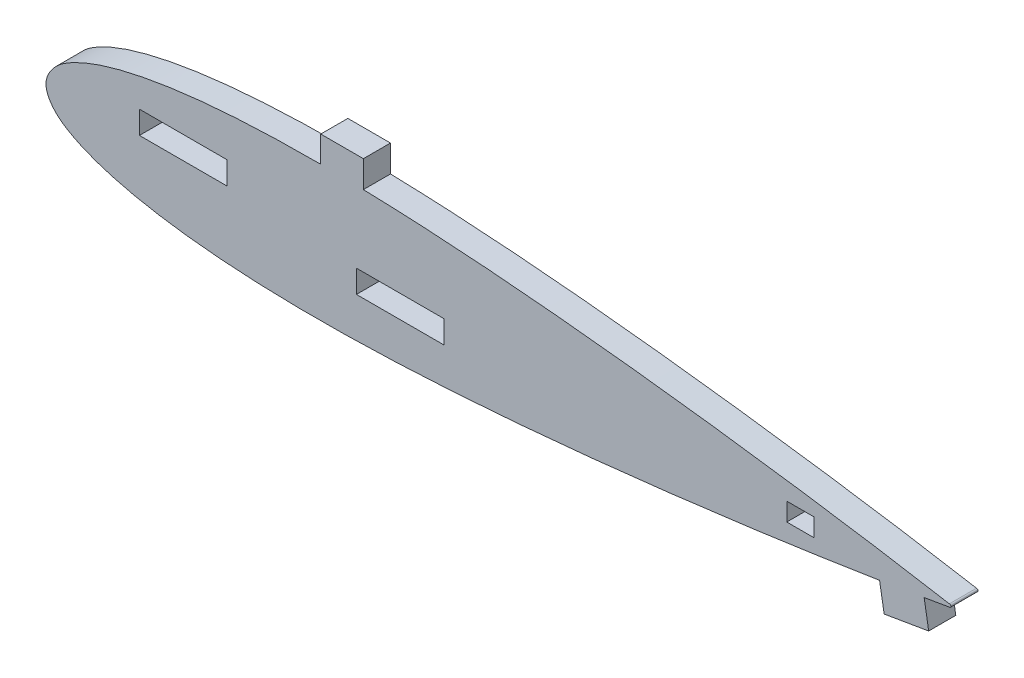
ISO-10303-21;
HEADER;
FILE_DESCRIPTION(('STEP AP214'),'2;1');
FILE_NAME('part.step','',(''),(''),'','','');
FILE_SCHEMA(('AUTOMOTIVE_DESIGN { 1 0 10303 214 1 1 1 1 }'));
ENDSEC;
DATA;
#1=APPLICATION_CONTEXT('core data for automotive mechanical design processes');
#2=APPLICATION_PROTOCOL_DEFINITION('international standard','automotive_design',2000,#1);
#3=PRODUCT_CONTEXT('',#1,'mechanical');
#4=PRODUCT('Part','Part','',(#3));
#5=PRODUCT_RELATED_PRODUCT_CATEGORY('part','',(#4));
#6=PRODUCT_DEFINITION_FORMATION('','',#4);
#7=PRODUCT_DEFINITION_CONTEXT('part definition',#1,'design');
#8=PRODUCT_DEFINITION('design','',#6,#7);
#9=PRODUCT_DEFINITION_SHAPE('','',#8);
#10=(LENGTH_UNIT() NAMED_UNIT(*) SI_UNIT(.MILLI.,.METRE.));
#11=(NAMED_UNIT(*) PLANE_ANGLE_UNIT() SI_UNIT($,.RADIAN.));
#12=(NAMED_UNIT(*) SI_UNIT($,.STERADIAN.) SOLID_ANGLE_UNIT());
#13=UNCERTAINTY_MEASURE_WITH_UNIT(LENGTH_MEASURE(1.E-05),#10,'distance_accuracy_value','');
#14=(GEOMETRIC_REPRESENTATION_CONTEXT(3) GLOBAL_UNCERTAINTY_ASSIGNED_CONTEXT((#13)) GLOBAL_UNIT_ASSIGNED_CONTEXT((#10,
#11,#12)) REPRESENTATION_CONTEXT('',''));
#15=CARTESIAN_POINT('',(0.,0.,0.));
#16=DIRECTION('',(0.,0.,1.));
#17=DIRECTION('',(1.,0.,0.));
#18=AXIS2_PLACEMENT_3D('',#15,#16,#17);
#19=CARTESIAN_POINT('',(100.000000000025,0.158000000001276,3.));
#20=CARTESIAN_POINT('',(98.3338853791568,0.44464004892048,3.));
#21=CARTESIAN_POINT('',(95.0042262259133,1.0174779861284,3.));
#22=CARTESIAN_POINT('',(88.3410028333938,2.08242492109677,3.));
#23=CARTESIAN_POINT('',(80.0113504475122,3.30498548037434,3.));
#24=CARTESIAN_POINT('',(70.0105130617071,4.60747842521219,3.));
#25=CARTESIAN_POINT('',(60.0106446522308,5.73730793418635,3.));
#26=CARTESIAN_POINT('',(50.0106674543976,6.66074506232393,3.));
#27=CARTESIAN_POINT('',(40.0091048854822,7.31676528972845,3.));
#28=CARTESIAN_POINT('',(31.6676242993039,7.54769531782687,3.));
#29=CARTESIAN_POINT('',(24.9971827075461,7.45673823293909,3.));
#30=CARTESIAN_POINT('',(19.9915913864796,7.20936739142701,3.));
#31=CARTESIAN_POINT('',(14.9791417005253,6.73336712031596,3.));
#32=CARTESIAN_POINT('',(10.8061355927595,6.06694884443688,3.));
#33=CARTESIAN_POINT('',(7.47344627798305,5.27452433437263,3.));
#34=CARTESIAN_POINT('',(4.94303751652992,4.47987863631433,3.));
#35=CARTESIAN_POINT('',(2.81574958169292,3.51542718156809,3.));
#36=CARTESIAN_POINT('',(0.906186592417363,2.23922347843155,3.));
#37=CARTESIAN_POINT('',(-0.575121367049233,3.46911754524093E-11,3.));
#38=CARTESIAN_POINT('',(0.9061865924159,-2.23922347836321,3.));
#39=CARTESIAN_POINT('',(2.81574958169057,-3.51542718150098,3.));
#40=CARTESIAN_POINT('',(4.94303751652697,-4.47987863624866,3.));
#41=CARTESIAN_POINT('',(7.47344627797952,-5.27452433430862,3.));
#42=CARTESIAN_POINT('',(10.8061355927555,-6.0669488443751,3.));
#43=CARTESIAN_POINT('',(14.9791417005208,-6.73336712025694,3.));
#44=CARTESIAN_POINT('',(19.9915913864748,-7.20936739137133,3.));
#45=CARTESIAN_POINT('',(24.9971827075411,-7.45673823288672,3.));
#46=CARTESIAN_POINT('',(31.6676242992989,-7.54769531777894,3.));
#47=CARTESIAN_POINT('',(40.0091048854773,-7.31676528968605,3.));
#48=CARTESIAN_POINT('',(50.0106674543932,-6.66074506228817,3.));
#49=CARTESIAN_POINT('',(60.0106446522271,-5.73730793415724,3.));
#50=CARTESIAN_POINT('',(70.010513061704,-4.60747842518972,3.));
#51=CARTESIAN_POINT('',(80.01135044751,-3.30498548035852,3.));
#52=CARTESIAN_POINT('',(87.4294075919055,-2.21622166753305,3.));
#53=CARTESIAN_POINT('',(91.5148918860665,-1.57299167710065,3.));
#54=CARTESIAN_POINT('',(92.2719450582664,-1.4520292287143,3.));
#55=B_SPLINE_CURVE_WITH_KNOTS('',3,(#19,#20,#21,#22,#23,#24,#25,#26,#27,#28,#29,#30,#31,#32,#33,
#34,#35,#36,#37,#38,#39,#40,#41,#42,#43,#44,#45,#46,#47,#48,#49,#50,#51,#52,#53,#54),
.UNSPECIFIED.,.F.,.F.,(4,1,1,1,1,1,1,1,1,1,1,1,1,1,1,1,1,1,1,1,1,1,1,1,1,1,1,1,1,1,1,1,1,4),(0.,
0.0246840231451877,0.0493299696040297,0.0985220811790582,0.147602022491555,0.19657827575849,
0.245450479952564,0.294218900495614,0.342903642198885,0.367241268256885,0.391607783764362,
0.416059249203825,0.440726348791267,0.453242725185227,0.466028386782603,0.479472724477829,
0.486972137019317,0.5,0.513027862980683,0.520527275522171,0.533971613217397,0.546757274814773,
0.559273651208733,0.583940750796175,0.608392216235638,0.632758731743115,0.657096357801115,
0.705781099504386,0.754549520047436,0.803421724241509,0.852397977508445,0.901477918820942,
0.95067003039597,0.961863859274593),.UNSPECIFIED.);
#56=DIRECTION('',(0.,0.,-1.));
#57=VECTOR('',#56,1.);
#58=SURFACE_OF_LINEAR_EXTRUSION('',#55,#57);
#59=CARTESIAN_POINT('',(30.4133333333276,7.50147555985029,3.));
#60=VERTEX_POINT('',#59);
#61=CARTESIAN_POINT('',(92.2719450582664,-1.4520292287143,3.));
#62=VERTEX_POINT('',#61);
#63=EDGE_CURVE('E366',#60,#62,#55,.T.);
#64=ORIENTED_EDGE('',*,*,#63,.F.);
#65=DIRECTION('',(0.,0.,-1.));
#66=VECTOR('',#65,1.);
#67=CARTESIAN_POINT('',(30.4133333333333,7.50147555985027,3.));
#68=LINE('',#67,#66);
#69=CARTESIAN_POINT('',(30.4133333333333,7.50147555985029,0.));
#70=VERTEX_POINT('',#69);
#71=EDGE_CURVE('E224',#60,#70,#68,.T.);
#72=ORIENTED_EDGE('',*,*,#71,.T.);
#73=CARTESIAN_POINT('',(100.000000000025,0.158000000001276,0.));
#74=CARTESIAN_POINT('',(98.3338853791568,0.44464004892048,0.));
#75=CARTESIAN_POINT('',(95.0042262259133,1.0174779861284,0.));
#76=CARTESIAN_POINT('',(88.3410028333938,2.08242492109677,0.));
#77=CARTESIAN_POINT('',(80.0113504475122,3.30498548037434,0.));
#78=CARTESIAN_POINT('',(70.0105130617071,4.60747842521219,0.));
#79=CARTESIAN_POINT('',(60.0106446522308,5.73730793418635,0.));
#80=CARTESIAN_POINT('',(50.0106674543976,6.66074506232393,0.));
#81=CARTESIAN_POINT('',(40.0091048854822,7.31676528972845,0.));
#82=CARTESIAN_POINT('',(31.6676242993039,7.54769531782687,0.));
#83=CARTESIAN_POINT('',(24.9971827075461,7.45673823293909,0.));
#84=CARTESIAN_POINT('',(19.9915913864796,7.20936739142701,0.));
#85=CARTESIAN_POINT('',(14.9791417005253,6.73336712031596,0.));
#86=CARTESIAN_POINT('',(10.8061355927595,6.06694884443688,0.));
#87=CARTESIAN_POINT('',(7.47344627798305,5.27452433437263,0.));
#88=CARTESIAN_POINT('',(4.94303751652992,4.47987863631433,0.));
#89=CARTESIAN_POINT('',(2.81574958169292,3.51542718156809,0.));
#90=CARTESIAN_POINT('',(0.906186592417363,2.23922347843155,0.));
#91=CARTESIAN_POINT('',(-0.575121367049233,3.46911754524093E-11,0.));
#92=CARTESIAN_POINT('',(0.9061865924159,-2.23922347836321,0.));
#93=CARTESIAN_POINT('',(2.81574958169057,-3.51542718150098,0.));
#94=CARTESIAN_POINT('',(4.94303751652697,-4.47987863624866,0.));
#95=CARTESIAN_POINT('',(7.47344627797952,-5.27452433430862,0.));
#96=CARTESIAN_POINT('',(10.8061355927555,-6.0669488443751,0.));
#97=CARTESIAN_POINT('',(14.9791417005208,-6.73336712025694,0.));
#98=CARTESIAN_POINT('',(19.9915913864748,-7.20936739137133,0.));
#99=CARTESIAN_POINT('',(24.9971827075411,-7.45673823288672,0.));
#100=CARTESIAN_POINT('',(31.6676242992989,-7.54769531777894,0.));
#101=CARTESIAN_POINT('',(40.0091048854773,-7.31676528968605,0.));
#102=CARTESIAN_POINT('',(50.0106674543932,-6.66074506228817,0.));
#103=CARTESIAN_POINT('',(60.0106446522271,-5.73730793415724,0.));
#104=CARTESIAN_POINT('',(70.010513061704,-4.60747842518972,0.));
#105=CARTESIAN_POINT('',(80.01135044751,-3.30498548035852,0.));
#106=CARTESIAN_POINT('',(87.4294075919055,-2.21622166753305,0.));
#107=CARTESIAN_POINT('',(91.5148918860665,-1.57299167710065,0.));
#108=CARTESIAN_POINT('',(92.2719450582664,-1.4520292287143,0.));
#109=B_SPLINE_CURVE_WITH_KNOTS('',3,(#73,#74,#75,#76,#77,#78,#79,#80,#81,#82,#83,#84,#85,#86,
#87,#88,#89,#90,#91,#92,#93,#94,#95,#96,#97,#98,#99,#100,#101,#102,#103,#104,#105,#106,#107,
#108),.UNSPECIFIED.,.F.,.F.,(4,1,1,1,1,1,1,1,1,1,1,1,1,1,1,1,1,1,1,1,1,1,1,1,1,1,1,1,1,1,1,1,1,
4),(0.,0.0246840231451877,0.0493299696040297,0.0985220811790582,0.147602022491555,
0.19657827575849,0.245450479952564,0.294218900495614,0.342903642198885,0.367241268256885,
0.391607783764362,0.416059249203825,0.440726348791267,0.453242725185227,0.466028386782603,
0.479472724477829,0.486972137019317,0.5,0.513027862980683,0.520527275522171,0.533971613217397,
0.546757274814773,0.559273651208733,0.583940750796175,0.608392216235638,0.632758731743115,
0.657096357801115,0.705781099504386,0.754549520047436,0.803421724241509,0.852397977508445,
0.901477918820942,0.95067003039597,0.961863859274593),.UNSPECIFIED.);
#110=CARTESIAN_POINT('',(92.2719450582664,-1.4520292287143,0.));
#111=VERTEX_POINT('',#110);
#112=EDGE_CURVE('E387',#70,#111,#109,.T.);
#113=ORIENTED_EDGE('',*,*,#112,.T.);
#114=DIRECTION('',(0.,0.,-1.));
#115=VECTOR('',#114,1.);
#116=CARTESIAN_POINT('',(92.2719450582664,-1.4520292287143,3.));
#117=LINE('',#116,#115);
#118=EDGE_CURVE('E49',#62,#111,#117,.T.);
#119=ORIENTED_EDGE('',*,*,#118,.F.);
#120=EDGE_LOOP('',(#64,#72,#113,#119));
#121=FACE_BOUND('',#120,.T.);
#122=ADVANCED_FACE('F40',(#121),#58,.F.);
#123=CARTESIAN_POINT('',(100.008153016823,0.,3.));
#124=DIRECTION('',(0.,0.,-1.));
#125=DIRECTION('',(-1.,0.,0.));
#126=AXIS2_PLACEMENT_3D('',#123,#124,#125);
#127=CYLINDRICAL_SURFACE('',#126,0.158210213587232);
#128=CARTESIAN_POINT('',(100.008153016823,0.,0.));
#129=DIRECTION('',(0.,0.,-1.));
#130=DIRECTION('',(-1.,0.,0.));
#131=AXIS2_PLACEMENT_3D('',#128,#129,#130);
#132=CIRCLE('',#131,0.158210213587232);
#133=CARTESIAN_POINT('',(100.000000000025,0.158000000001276,0.));
#134=VERTEX_POINT('',#133);
#135=CARTESIAN_POINT('',(100.,-0.158,0.));
#136=VERTEX_POINT('',#135);
#137=EDGE_CURVE('E254',#134,#136,#132,.T.);
#138=ORIENTED_EDGE('',*,*,#137,.F.);
#139=DIRECTION('',(0.,0.,-1.));
#140=VECTOR('',#139,1.);
#141=CARTESIAN_POINT('',(100.000000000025,0.158000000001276,3.));
#142=LINE('',#141,#140);
#143=CARTESIAN_POINT('',(100.000000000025,0.158000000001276,3.));
#144=VERTEX_POINT('',#143);
#145=EDGE_CURVE('E11',#144,#134,#142,.T.);
#146=ORIENTED_EDGE('',*,*,#145,.F.);
#147=CARTESIAN_POINT('',(100.008153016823,0.,3.));
#148=DIRECTION('',(0.,0.,-1.));
#149=DIRECTION('',(-1.,0.,0.));
#150=AXIS2_PLACEMENT_3D('',#147,#148,#149);
#151=CIRCLE('',#150,0.158210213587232);
#152=CARTESIAN_POINT('',(100.,-0.158,3.));
#153=VERTEX_POINT('',#152);
#154=EDGE_CURVE('E322',#144,#153,#151,.T.);
#155=ORIENTED_EDGE('',*,*,#154,.T.);
#156=DIRECTION('',(0.,0.,-1.));
#157=VECTOR('',#156,1.);
#158=CARTESIAN_POINT('',(100.,-0.158,3.));
#159=LINE('',#158,#157);
#160=EDGE_CURVE('E44',#153,#136,#159,.T.);
#161=ORIENTED_EDGE('',*,*,#160,.T.);
#162=EDGE_LOOP('',(#138,#146,#155,#161));
#163=FACE_BOUND('',#162,.T.);
#164=ADVANCED_FACE('F42',(#163),#127,.T.);
#165=CARTESIAN_POINT('',(35.1333333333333,7.43263395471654,0.));
#166=VERTEX_POINT('',#165);
#167=EDGE_CURVE('E326',#134,#166,#109,.T.);
#168=ORIENTED_EDGE('',*,*,#167,.T.);
#169=DIRECTION('',(0.,0.,-1.));
#170=VECTOR('',#169,1.);
#171=CARTESIAN_POINT('',(35.1333333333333,7.43263395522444,3.));
#172=LINE('',#171,#170);
#173=CARTESIAN_POINT('',(35.1333333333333,7.43263395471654,3.));
#174=VERTEX_POINT('',#173);
#175=EDGE_CURVE('E197',#166,#174,#172,.F.);
#176=ORIENTED_EDGE('',*,*,#175,.T.);
#177=EDGE_CURVE('E359',#144,#174,#55,.T.);
#178=ORIENTED_EDGE('',*,*,#177,.F.);
#179=ORIENTED_EDGE('',*,*,#145,.T.);
#180=EDGE_LOOP('',(#168,#176,#178,#179));
#181=FACE_BOUND('',#180,.T.);
#182=ADVANCED_FACE('F352',(#181),#58,.F.);
#183=CARTESIAN_POINT('',(92.2719450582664,-1.4520292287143,3.));
#184=DIRECTION('',(0.985835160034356,0.167717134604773,0.));
#185=DIRECTION('',(-0.167717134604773,0.985835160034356,0.));
#186=AXIS2_PLACEMENT_3D('',#183,#184,#185);
#187=PLANE('',#186);
#188=DIRECTION('',(0.167717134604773,-0.985835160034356,0.));
#189=VECTOR('',#188,1.);
#190=CARTESIAN_POINT('',(92.2719450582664,-1.4520292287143,0.));
#191=LINE('',#190,#189);
#192=CARTESIAN_POINT('',(92.7791121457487,-4.43313874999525,0.));
#193=VERTEX_POINT('',#192);
#194=EDGE_CURVE('E385',#111,#193,#191,.T.);
#195=ORIENTED_EDGE('',*,*,#194,.T.);
#196=DIRECTION('',(0.,0.,-1.));
#197=VECTOR('',#196,1.);
#198=CARTESIAN_POINT('',(92.7791121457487,-4.43313874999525,3.));
#199=LINE('',#198,#197);
#200=CARTESIAN_POINT('',(92.7791121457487,-4.43313874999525,3.));
#201=VERTEX_POINT('',#200);
#202=EDGE_CURVE('E396',#201,#193,#199,.T.);
#203=ORIENTED_EDGE('',*,*,#202,.F.);
#204=DIRECTION('',(0.167717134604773,-0.985835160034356,0.));
#205=VECTOR('',#204,1.);
#206=CARTESIAN_POINT('',(92.2719450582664,-1.4520292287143,3.));
#207=LINE('',#206,#205);
#208=EDGE_CURVE('E367',#62,#201,#207,.T.);
#209=ORIENTED_EDGE('',*,*,#208,.F.);
#210=ORIENTED_EDGE('',*,*,#118,.T.);
#211=EDGE_LOOP('',(#195,#203,#209,#210));
#212=FACE_BOUND('',#211,.T.);
#213=ADVANCED_FACE('F348',(#212),#187,.F.);
#214=CARTESIAN_POINT('',(92.7791121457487,-4.43313874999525,3.));
#215=DIRECTION('',(-0.167717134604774,0.985835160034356,0.));
#216=DIRECTION('',(-0.985835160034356,-0.167717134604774,0.));
#217=AXIS2_PLACEMENT_3D('',#214,#215,#216);
#218=PLANE('',#217);
#219=DIRECTION('',(0.985835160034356,0.167717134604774,0.));
#220=VECTOR('',#219,1.);
#221=CARTESIAN_POINT('',(92.7791121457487,-4.43313874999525,0.));
#222=LINE('',#221,#220);
#223=CARTESIAN_POINT('',(97.7082879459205,-3.59455307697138,0.));
#224=VERTEX_POINT('',#223);
#225=EDGE_CURVE('E383',#193,#224,#222,.T.);
#226=ORIENTED_EDGE('',*,*,#225,.T.);
#227=DIRECTION('',(0.,0.,-1.));
#228=VECTOR('',#227,1.);
#229=CARTESIAN_POINT('',(97.7082879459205,-3.59455307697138,3.));
#230=LINE('',#229,#228);
#231=CARTESIAN_POINT('',(97.7082879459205,-3.59455307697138,3.));
#232=VERTEX_POINT('',#231);
#233=EDGE_CURVE('E399',#232,#224,#230,.T.);
#234=ORIENTED_EDGE('',*,*,#233,.F.);
#235=DIRECTION('',(0.985835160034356,0.167717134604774,0.));
#236=VECTOR('',#235,1.);
#237=CARTESIAN_POINT('',(92.7791121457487,-4.43313874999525,3.));
#238=LINE('',#237,#236);
#239=EDGE_CURVE('E415',#201,#232,#238,.T.);
#240=ORIENTED_EDGE('',*,*,#239,.F.);
#241=ORIENTED_EDGE('',*,*,#202,.T.);
#242=EDGE_LOOP('',(#226,#234,#240,#241));
#243=FACE_BOUND('',#242,.T.);
#244=ADVANCED_FACE('F344',(#243),#218,.F.);
#245=CARTESIAN_POINT('',(97.7082879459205,-3.59455307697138,3.));
#246=DIRECTION('',(-0.985835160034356,-0.167717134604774,0.));
#247=DIRECTION('',(0.167717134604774,-0.985835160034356,0.));
#248=AXIS2_PLACEMENT_3D('',#245,#246,#247);
#249=PLANE('',#248);
#250=DIRECTION('',(-0.167717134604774,0.985835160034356,0.));
#251=VECTOR('',#250,1.);
#252=CARTESIAN_POINT('',(97.7082879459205,-3.59455307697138,0.));
#253=LINE('',#252,#251);
#254=CARTESIAN_POINT('',(97.2051365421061,-0.637047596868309,0.));
#255=VERTEX_POINT('',#254);
#256=EDGE_CURVE('E378',#224,#255,#253,.T.);
#257=ORIENTED_EDGE('',*,*,#256,.T.);
#258=DIRECTION('',(0.,0.,-1.));
#259=VECTOR('',#258,1.);
#260=CARTESIAN_POINT('',(97.2051365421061,-0.637047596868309,3.));
#261=LINE('',#260,#259);
#262=CARTESIAN_POINT('',(97.2051365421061,-0.637047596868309,3.));
#263=VERTEX_POINT('',#262);
#264=EDGE_CURVE('E401',#263,#255,#261,.T.);
#265=ORIENTED_EDGE('',*,*,#264,.F.);
#266=DIRECTION('',(-0.167717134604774,0.985835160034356,0.));
#267=VECTOR('',#266,1.);
#268=CARTESIAN_POINT('',(97.7082879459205,-3.59455307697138,3.));
#269=LINE('',#268,#267);
#270=EDGE_CURVE('E331',#232,#263,#269,.T.);
#271=ORIENTED_EDGE('',*,*,#270,.F.);
#272=ORIENTED_EDGE('',*,*,#233,.T.);
#273=EDGE_LOOP('',(#257,#265,#271,#272));
#274=FACE_BOUND('',#273,.T.);
#275=ADVANCED_FACE('F340',(#274),#249,.F.);
#276=CARTESIAN_POINT('',(97.2051365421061,-0.637047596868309,3.));
#277=CARTESIAN_POINT('',(98.1369506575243,-0.478520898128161,3.));
#278=CARTESIAN_POINT('',(99.0684753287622,-0.318260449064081,3.));
#279=CARTESIAN_POINT('',(100.,-0.158,3.));
#280=B_SPLINE_CURVE_WITH_KNOTS('',3,(#276,#277,#278,#279),.UNSPECIFIED.,.F.,.F.,(4,4),
(0.986199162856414,1.),.UNSPECIFIED.);
#281=DIRECTION('',(0.,0.,-1.));
#282=VECTOR('',#281,1.);
#283=SURFACE_OF_LINEAR_EXTRUSION('',#280,#282);
#284=CARTESIAN_POINT('',(97.2051365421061,-0.637047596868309,0.));
#285=CARTESIAN_POINT('',(98.1369506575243,-0.478520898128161,0.));
#286=CARTESIAN_POINT('',(99.0684753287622,-0.318260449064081,0.));
#287=CARTESIAN_POINT('',(100.,-0.158,0.));
#288=B_SPLINE_CURVE_WITH_KNOTS('',3,(#284,#285,#286,#287),.UNSPECIFIED.,.F.,.F.,(4,4),
(0.986199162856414,1.),.UNSPECIFIED.);
#289=EDGE_CURVE('E373',#255,#136,#288,.T.);
#290=ORIENTED_EDGE('',*,*,#289,.T.);
#291=ORIENTED_EDGE('',*,*,#160,.F.);
#292=EDGE_CURVE('E325',#263,#153,#280,.T.);
#293=ORIENTED_EDGE('',*,*,#292,.F.);
#294=ORIENTED_EDGE('',*,*,#264,.T.);
#295=EDGE_LOOP('',(#290,#291,#293,#294));
#296=FACE_BOUND('',#295,.T.);
#297=ADVANCED_FACE('F336',(#296),#283,.F.);
#298=CARTESIAN_POINT('',(100.008153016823,0.,3.));
#299=DIRECTION('',(0.,0.,-1.));
#300=DIRECTION('',(-1.,0.,0.));
#301=AXIS2_PLACEMENT_3D('',#298,#299,#300);
#302=PLANE('',#301);
#303=ORIENTED_EDGE('',*,*,#177,.T.);
#304=DIRECTION('',(0.,1.,0.));
#305=VECTOR('',#304,1.);
#306=CARTESIAN_POINT('',(35.1333333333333,10.4,3.));
#307=LINE('',#306,#305);
#308=CARTESIAN_POINT('',(35.1333333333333,10.4,3.));
#309=VERTEX_POINT('',#308);
#310=EDGE_CURVE('E219',#174,#309,#307,.T.);
#311=ORIENTED_EDGE('',*,*,#310,.T.);
#312=DIRECTION('',(-1.,0.,0.));
#313=VECTOR('',#312,1.);
#314=CARTESIAN_POINT('',(30.4133333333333,10.4,3.));
#315=LINE('',#314,#313);
#316=CARTESIAN_POINT('',(30.4133333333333,10.4,3.));
#317=VERTEX_POINT('',#316);
#318=EDGE_CURVE('E208',#309,#317,#315,.T.);
#319=ORIENTED_EDGE('',*,*,#318,.T.);
#320=DIRECTION('',(0.,-1.,0.));
#321=VECTOR('',#320,1.);
#322=CARTESIAN_POINT('',(30.4133333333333,10.4,3.));
#323=LINE('',#322,#321);
#324=EDGE_CURVE('E57',#317,#60,#323,.T.);
#325=ORIENTED_EDGE('',*,*,#324,.T.);
#326=ORIENTED_EDGE('',*,*,#63,.T.);
#327=ORIENTED_EDGE('',*,*,#208,.T.);
#328=ORIENTED_EDGE('',*,*,#239,.T.);
#329=ORIENTED_EDGE('',*,*,#270,.T.);
#330=ORIENTED_EDGE('',*,*,#292,.T.);
#331=ORIENTED_EDGE('',*,*,#154,.F.);
#332=EDGE_LOOP('',(#303,#311,#319,#325,#326,#327,#328,#329,#330,#331));
#333=FACE_BOUND('',#332,.T.);
#334=DIRECTION('',(1.,0.,0.));
#335=VECTOR('',#334,1.);
#336=CARTESIAN_POINT('',(81.9996965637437,-1.,3.));
#337=LINE('',#336,#335);
#338=CARTESIAN_POINT('',(81.9996965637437,-1.,3.));
#339=VERTEX_POINT('',#338);
#340=CARTESIAN_POINT('',(84.9996965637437,-1.,3.));
#341=VERTEX_POINT('',#340);
#342=EDGE_CURVE('E243',#339,#341,#337,.T.);
#343=ORIENTED_EDGE('',*,*,#342,.F.);
#344=DIRECTION('',(0.,-1.,0.));
#345=VECTOR('',#344,1.);
#346=CARTESIAN_POINT('',(81.9996965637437,1.,3.));
#347=LINE('',#346,#345);
#348=CARTESIAN_POINT('',(81.9996965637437,1.,3.));
#349=VERTEX_POINT('',#348);
#350=EDGE_CURVE('E65',#349,#339,#347,.T.);
#351=ORIENTED_EDGE('',*,*,#350,.F.);
#352=DIRECTION('',(-1.,0.,0.));
#353=VECTOR('',#352,1.);
#354=CARTESIAN_POINT('',(81.9996965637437,1.,3.));
#355=LINE('',#354,#353);
#356=CARTESIAN_POINT('',(84.9996965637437,1.,3.));
#357=VERTEX_POINT('',#356);
#358=EDGE_CURVE('E232',#357,#349,#355,.T.);
#359=ORIENTED_EDGE('',*,*,#358,.F.);
#360=DIRECTION('',(0.,1.,0.));
#361=VECTOR('',#360,1.);
#362=CARTESIAN_POINT('',(84.9996965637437,1.,3.));
#363=LINE('',#362,#361);
#364=EDGE_CURVE('E247',#341,#357,#363,.T.);
#365=ORIENTED_EDGE('',*,*,#364,.F.);
#366=EDGE_LOOP('',(#343,#351,#359,#365));
#367=FACE_BOUND('',#366,.T.);
#368=DIRECTION('',(1.,0.,0.));
#369=VECTOR('',#368,1.);
#370=CARTESIAN_POINT('',(34.3633333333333,-3.,3.));
#371=LINE('',#370,#369);
#372=CARTESIAN_POINT('',(34.3633333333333,-3.,3.));
#373=VERTEX_POINT('',#372);
#374=CARTESIAN_POINT('',(44.0833333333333,-3.,3.));
#375=VERTEX_POINT('',#374);
#376=EDGE_CURVE('E278',#373,#375,#371,.T.);
#377=ORIENTED_EDGE('',*,*,#376,.F.);
#378=DIRECTION('',(0.,-1.,0.));
#379=VECTOR('',#378,1.);
#380=CARTESIAN_POINT('',(34.3633333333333,-0.48,3.));
#381=LINE('',#380,#379);
#382=CARTESIAN_POINT('',(34.3633333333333,-0.48,3.));
#383=VERTEX_POINT('',#382);
#384=EDGE_CURVE('E244',#383,#373,#381,.T.);
#385=ORIENTED_EDGE('',*,*,#384,.F.);
#386=DIRECTION('',(-1.,0.,0.));
#387=VECTOR('',#386,1.);
#388=CARTESIAN_POINT('',(34.3633333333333,-0.48,3.));
#389=LINE('',#388,#387);
#390=CARTESIAN_POINT('',(44.0833333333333,-0.48,3.));
#391=VERTEX_POINT('',#390);
#392=EDGE_CURVE('E271',#391,#383,#389,.T.);
#393=ORIENTED_EDGE('',*,*,#392,.F.);
#394=DIRECTION('',(0.,1.,0.));
#395=VECTOR('',#394,1.);
#396=CARTESIAN_POINT('',(44.0833333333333,-0.48,3.));
#397=LINE('',#396,#395);
#398=EDGE_CURVE('E274',#375,#391,#397,.T.);
#399=ORIENTED_EDGE('',*,*,#398,.F.);
#400=EDGE_LOOP('',(#377,#385,#393,#399));
#401=FACE_BOUND('',#400,.T.);
#402=DIRECTION('',(1.,0.,0.));
#403=VECTOR('',#402,1.);
#404=CARTESIAN_POINT('',(10.3433333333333,0.23,3.));
#405=LINE('',#404,#403);
#406=CARTESIAN_POINT('',(10.3433333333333,0.23,3.));
#407=VERTEX_POINT('',#406);
#408=CARTESIAN_POINT('',(20.0633333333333,0.23,3.));
#409=VERTEX_POINT('',#408);
#410=EDGE_CURVE('E308',#407,#409,#405,.T.);
#411=ORIENTED_EDGE('',*,*,#410,.F.);
#412=DIRECTION('',(0.,-1.,0.));
#413=VECTOR('',#412,1.);
#414=CARTESIAN_POINT('',(10.3433333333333,2.75,3.));
#415=LINE('',#414,#413);
#416=CARTESIAN_POINT('',(10.3433333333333,2.75,3.));
#417=VERTEX_POINT('',#416);
#418=EDGE_CURVE('E270',#417,#407,#415,.T.);
#419=ORIENTED_EDGE('',*,*,#418,.F.);
#420=DIRECTION('',(-1.,0.,0.));
#421=VECTOR('',#420,1.);
#422=CARTESIAN_POINT('',(10.3433333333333,2.75,3.));
#423=LINE('',#422,#421);
#424=CARTESIAN_POINT('',(20.0633333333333,2.75,3.));
#425=VERTEX_POINT('',#424);
#426=EDGE_CURVE('E301',#425,#417,#423,.T.);
#427=ORIENTED_EDGE('',*,*,#426,.F.);
#428=DIRECTION('',(0.,1.,0.));
#429=VECTOR('',#428,1.);
#430=CARTESIAN_POINT('',(20.0633333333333,2.75,3.));
#431=LINE('',#430,#429);
#432=EDGE_CURVE('E304',#409,#425,#431,.T.);
#433=ORIENTED_EDGE('',*,*,#432,.F.);
#434=EDGE_LOOP('',(#411,#419,#427,#433));
#435=FACE_BOUND('',#434,.T.);
#436=ADVANCED_FACE('F339',(#333,#367,#401,#435),#302,.F.);
#437=CARTESIAN_POINT('',(100.008153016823,0.,0.));
#438=DIRECTION('',(0.,0.,-1.));
#439=DIRECTION('',(-1.,0.,0.));
#440=AXIS2_PLACEMENT_3D('',#437,#438,#439);
#441=PLANE('',#440);
#442=ORIENTED_EDGE('',*,*,#112,.F.);
#443=DIRECTION('',(0.,-1.,0.));
#444=VECTOR('',#443,1.);
#445=CARTESIAN_POINT('',(30.4133333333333,10.4,0.));
#446=LINE('',#445,#444);
#447=CARTESIAN_POINT('',(30.4133333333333,10.4,0.));
#448=VERTEX_POINT('',#447);
#449=EDGE_CURVE('E203',#448,#70,#446,.T.);
#450=ORIENTED_EDGE('',*,*,#449,.F.);
#451=DIRECTION('',(-1.,0.,0.));
#452=VECTOR('',#451,1.);
#453=CARTESIAN_POINT('',(30.4133333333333,10.4,0.));
#454=LINE('',#453,#452);
#455=CARTESIAN_POINT('',(35.1333333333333,10.4,0.));
#456=VERTEX_POINT('',#455);
#457=EDGE_CURVE('E202',#456,#448,#454,.T.);
#458=ORIENTED_EDGE('',*,*,#457,.F.);
#459=DIRECTION('',(0.,1.,0.));
#460=VECTOR('',#459,1.);
#461=CARTESIAN_POINT('',(35.1333333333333,10.4,0.));
#462=LINE('',#461,#460);
#463=EDGE_CURVE('E191',#166,#456,#462,.T.);
#464=ORIENTED_EDGE('',*,*,#463,.F.);
#465=ORIENTED_EDGE('',*,*,#167,.F.);
#466=ORIENTED_EDGE('',*,*,#137,.T.);
#467=ORIENTED_EDGE('',*,*,#289,.F.);
#468=ORIENTED_EDGE('',*,*,#256,.F.);
#469=ORIENTED_EDGE('',*,*,#225,.F.);
#470=ORIENTED_EDGE('',*,*,#194,.F.);
#471=EDGE_LOOP('',(#442,#450,#458,#464,#465,#466,#467,#468,#469,#470));
#472=FACE_BOUND('',#471,.T.);
#473=DIRECTION('',(0.,-1.,0.));
#474=VECTOR('',#473,1.);
#475=CARTESIAN_POINT('',(81.9996965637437,1.,0.));
#476=LINE('',#475,#474);
#477=CARTESIAN_POINT('',(81.9996965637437,1.,0.));
#478=VERTEX_POINT('',#477);
#479=CARTESIAN_POINT('',(81.9996965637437,-1.,0.));
#480=VERTEX_POINT('',#479);
#481=EDGE_CURVE('E228',#478,#480,#476,.T.);
#482=ORIENTED_EDGE('',*,*,#481,.T.);
#483=DIRECTION('',(1.,0.,0.));
#484=VECTOR('',#483,1.);
#485=CARTESIAN_POINT('',(81.9996965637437,-1.,0.));
#486=LINE('',#485,#484);
#487=CARTESIAN_POINT('',(84.9996965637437,-1.,0.));
#488=VERTEX_POINT('',#487);
#489=EDGE_CURVE('E231',#480,#488,#486,.T.);
#490=ORIENTED_EDGE('',*,*,#489,.T.);
#491=DIRECTION('',(0.,1.,0.));
#492=VECTOR('',#491,1.);
#493=CARTESIAN_POINT('',(84.9996965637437,1.,0.));
#494=LINE('',#493,#492);
#495=CARTESIAN_POINT('',(84.9996965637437,1.,0.));
#496=VERTEX_POINT('',#495);
#497=EDGE_CURVE('E235',#488,#496,#494,.T.);
#498=ORIENTED_EDGE('',*,*,#497,.T.);
#499=DIRECTION('',(-1.,0.,0.));
#500=VECTOR('',#499,1.);
#501=CARTESIAN_POINT('',(81.9996965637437,1.,0.));
#502=LINE('',#501,#500);
#503=EDGE_CURVE('E238',#496,#478,#502,.T.);
#504=ORIENTED_EDGE('',*,*,#503,.T.);
#505=EDGE_LOOP('',(#482,#490,#498,#504));
#506=FACE_BOUND('',#505,.T.);
#507=DIRECTION('',(0.,-1.,0.));
#508=VECTOR('',#507,1.);
#509=CARTESIAN_POINT('',(34.3633333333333,-0.48,0.));
#510=LINE('',#509,#508);
#511=CARTESIAN_POINT('',(34.3633333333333,-0.48,0.));
#512=VERTEX_POINT('',#511);
#513=CARTESIAN_POINT('',(34.3633333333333,-3.,0.));
#514=VERTEX_POINT('',#513);
#515=EDGE_CURVE('E275',#512,#514,#510,.T.);
#516=ORIENTED_EDGE('',*,*,#515,.T.);
#517=DIRECTION('',(1.,0.,0.));
#518=VECTOR('',#517,1.);
#519=CARTESIAN_POINT('',(34.3633333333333,-3.,0.));
#520=LINE('',#519,#518);
#521=CARTESIAN_POINT('',(44.0833333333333,-3.,0.));
#522=VERTEX_POINT('',#521);
#523=EDGE_CURVE('E287',#514,#522,#520,.T.);
#524=ORIENTED_EDGE('',*,*,#523,.T.);
#525=DIRECTION('',(0.,1.,0.));
#526=VECTOR('',#525,1.);
#527=CARTESIAN_POINT('',(44.0833333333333,-0.48,0.));
#528=LINE('',#527,#526);
#529=CARTESIAN_POINT('',(44.0833333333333,-0.48,0.));
#530=VERTEX_POINT('',#529);
#531=EDGE_CURVE('E284',#522,#530,#528,.T.);
#532=ORIENTED_EDGE('',*,*,#531,.T.);
#533=DIRECTION('',(-1.,0.,0.));
#534=VECTOR('',#533,1.);
#535=CARTESIAN_POINT('',(34.3633333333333,-0.48,0.));
#536=LINE('',#535,#534);
#537=EDGE_CURVE('E263',#530,#512,#536,.T.);
#538=ORIENTED_EDGE('',*,*,#537,.T.);
#539=EDGE_LOOP('',(#516,#524,#532,#538));
#540=FACE_BOUND('',#539,.T.);
#541=DIRECTION('',(0.,-1.,0.));
#542=VECTOR('',#541,1.);
#543=CARTESIAN_POINT('',(10.3433333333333,2.75,0.));
#544=LINE('',#543,#542);
#545=CARTESIAN_POINT('',(10.3433333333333,2.75,0.));
#546=VERTEX_POINT('',#545);
#547=CARTESIAN_POINT('',(10.3433333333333,0.23,0.));
#548=VERTEX_POINT('',#547);
#549=EDGE_CURVE('E305',#546,#548,#544,.T.);
#550=ORIENTED_EDGE('',*,*,#549,.T.);
#551=DIRECTION('',(1.,0.,0.));
#552=VECTOR('',#551,1.);
#553=CARTESIAN_POINT('',(10.3433333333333,0.23,0.));
#554=LINE('',#553,#552);
#555=CARTESIAN_POINT('',(20.0633333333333,0.23,0.));
#556=VERTEX_POINT('',#555);
#557=EDGE_CURVE('E317',#548,#556,#554,.T.);
#558=ORIENTED_EDGE('',*,*,#557,.T.);
#559=DIRECTION('',(0.,1.,0.));
#560=VECTOR('',#559,1.);
#561=CARTESIAN_POINT('',(20.0633333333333,2.75,0.));
#562=LINE('',#561,#560);
#563=CARTESIAN_POINT('',(20.0633333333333,2.75,0.));
#564=VERTEX_POINT('',#563);
#565=EDGE_CURVE('E314',#556,#564,#562,.T.);
#566=ORIENTED_EDGE('',*,*,#565,.T.);
#567=DIRECTION('',(-1.,0.,0.));
#568=VECTOR('',#567,1.);
#569=CARTESIAN_POINT('',(10.3433333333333,2.75,0.));
#570=LINE('',#569,#568);
#571=EDGE_CURVE('E295',#564,#546,#570,.T.);
#572=ORIENTED_EDGE('',*,*,#571,.T.);
#573=EDGE_LOOP('',(#550,#558,#566,#572));
#574=FACE_BOUND('',#573,.T.);
#575=ADVANCED_FACE('F213',(#472,#506,#540,#574),#441,.T.);
#576=CARTESIAN_POINT('',(10.3433333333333,2.75,0.));
#577=DIRECTION('',(-1.,0.,0.));
#578=DIRECTION('',(0.,0.,1.));
#579=AXIS2_PLACEMENT_3D('',#576,#577,#578);
#580=PLANE('',#579);
#581=ORIENTED_EDGE('',*,*,#418,.T.);
#582=DIRECTION('',(0.,0.,1.));
#583=VECTOR('',#582,1.);
#584=CARTESIAN_POINT('',(10.3433333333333,0.23,0.));
#585=LINE('',#584,#583);
#586=EDGE_CURVE('E292',#548,#407,#585,.T.);
#587=ORIENTED_EDGE('',*,*,#586,.F.);
#588=ORIENTED_EDGE('',*,*,#549,.F.);
#589=DIRECTION('',(0.,0.,1.));
#590=VECTOR('',#589,1.);
#591=CARTESIAN_POINT('',(10.3433333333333,2.75,0.));
#592=LINE('',#591,#590);
#593=EDGE_CURVE('E227',#546,#417,#592,.T.);
#594=ORIENTED_EDGE('',*,*,#593,.T.);
#595=EDGE_LOOP('',(#581,#587,#588,#594));
#596=FACE_BOUND('',#595,.T.);
#597=ADVANCED_FACE('F476',(#596),#580,.F.);
#598=CARTESIAN_POINT('',(10.3433333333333,2.75,0.));
#599=DIRECTION('',(0.,1.,0.));
#600=DIRECTION('',(0.,0.,1.));
#601=AXIS2_PLACEMENT_3D('',#598,#599,#600);
#602=PLANE('',#601);
#603=ORIENTED_EDGE('',*,*,#426,.T.);
#604=ORIENTED_EDGE('',*,*,#593,.F.);
#605=ORIENTED_EDGE('',*,*,#571,.F.);
#606=DIRECTION('',(0.,0.,1.));
#607=VECTOR('',#606,1.);
#608=CARTESIAN_POINT('',(20.0633333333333,2.75,0.));
#609=LINE('',#608,#607);
#610=EDGE_CURVE('E298',#564,#425,#609,.T.);
#611=ORIENTED_EDGE('',*,*,#610,.T.);
#612=EDGE_LOOP('',(#603,#604,#605,#611));
#613=FACE_BOUND('',#612,.T.);
#614=ADVANCED_FACE('F481',(#613),#602,.F.);
#615=CARTESIAN_POINT('',(20.0633333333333,2.75,0.));
#616=DIRECTION('',(1.,0.,0.));
#617=DIRECTION('',(0.,0.,-1.));
#618=AXIS2_PLACEMENT_3D('',#615,#616,#617);
#619=PLANE('',#618);
#620=ORIENTED_EDGE('',*,*,#432,.T.);
#621=ORIENTED_EDGE('',*,*,#610,.F.);
#622=ORIENTED_EDGE('',*,*,#565,.F.);
#623=DIRECTION('',(0.,0.,1.));
#624=VECTOR('',#623,1.);
#625=CARTESIAN_POINT('',(20.0633333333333,0.23,0.));
#626=LINE('',#625,#624);
#627=EDGE_CURVE('E296',#556,#409,#626,.T.);
#628=ORIENTED_EDGE('',*,*,#627,.T.);
#629=EDGE_LOOP('',(#620,#621,#622,#628));
#630=FACE_BOUND('',#629,.T.);
#631=ADVANCED_FACE('F489',(#630),#619,.F.);
#632=CARTESIAN_POINT('',(10.3433333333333,0.23,0.));
#633=DIRECTION('',(0.,-1.,0.));
#634=DIRECTION('',(0.,0.,-1.));
#635=AXIS2_PLACEMENT_3D('',#632,#633,#634);
#636=PLANE('',#635);
#637=ORIENTED_EDGE('',*,*,#410,.T.);
#638=ORIENTED_EDGE('',*,*,#627,.F.);
#639=ORIENTED_EDGE('',*,*,#557,.F.);
#640=ORIENTED_EDGE('',*,*,#586,.T.);
#641=EDGE_LOOP('',(#637,#638,#639,#640));
#642=FACE_BOUND('',#641,.T.);
#643=ADVANCED_FACE('F497',(#642),#636,.F.);
#644=CARTESIAN_POINT('',(34.3633333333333,-0.48,0.));
#645=DIRECTION('',(-1.,0.,0.));
#646=DIRECTION('',(0.,-1.,0.));
#647=AXIS2_PLACEMENT_3D('',#644,#645,#646);
#648=PLANE('',#647);
#649=ORIENTED_EDGE('',*,*,#384,.T.);
#650=DIRECTION('',(0.,0.,1.));
#651=VECTOR('',#650,1.);
#652=CARTESIAN_POINT('',(34.3633333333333,-3.,0.));
#653=LINE('',#652,#651);
#654=EDGE_CURVE('E260',#514,#373,#653,.T.);
#655=ORIENTED_EDGE('',*,*,#654,.F.);
#656=ORIENTED_EDGE('',*,*,#515,.F.);
#657=DIRECTION('',(0.,0.,1.));
#658=VECTOR('',#657,1.);
#659=CARTESIAN_POINT('',(34.3633333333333,-0.48,0.));
#660=LINE('',#659,#658);
#661=EDGE_CURVE('E268',#512,#383,#660,.T.);
#662=ORIENTED_EDGE('',*,*,#661,.T.);
#663=EDGE_LOOP('',(#649,#655,#656,#662));
#664=FACE_BOUND('',#663,.T.);
#665=ADVANCED_FACE('F505',(#664),#648,.F.);
#666=CARTESIAN_POINT('',(34.3633333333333,-0.48,0.));
#667=DIRECTION('',(0.,1.,0.));
#668=DIRECTION('',(0.,0.,1.));
#669=AXIS2_PLACEMENT_3D('',#666,#667,#668);
#670=PLANE('',#669);
#671=ORIENTED_EDGE('',*,*,#392,.T.);
#672=ORIENTED_EDGE('',*,*,#661,.F.);
#673=ORIENTED_EDGE('',*,*,#537,.F.);
#674=DIRECTION('',(0.,0.,1.));
#675=VECTOR('',#674,1.);
#676=CARTESIAN_POINT('',(44.0833333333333,-0.48,0.));
#677=LINE('',#676,#675);
#678=EDGE_CURVE('E266',#530,#391,#677,.T.);
#679=ORIENTED_EDGE('',*,*,#678,.T.);
#680=EDGE_LOOP('',(#671,#672,#673,#679));
#681=FACE_BOUND('',#680,.T.);
#682=ADVANCED_FACE('F513',(#681),#670,.F.);
#683=CARTESIAN_POINT('',(44.0833333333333,-0.48,0.));
#684=DIRECTION('',(1.,0.,0.));
#685=DIRECTION('',(0.,1.,0.));
#686=AXIS2_PLACEMENT_3D('',#683,#684,#685);
#687=PLANE('',#686);
#688=ORIENTED_EDGE('',*,*,#398,.T.);
#689=ORIENTED_EDGE('',*,*,#678,.F.);
#690=ORIENTED_EDGE('',*,*,#531,.F.);
#691=DIRECTION('',(0.,0.,1.));
#692=VECTOR('',#691,1.);
#693=CARTESIAN_POINT('',(44.0833333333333,-3.,0.));
#694=LINE('',#693,#692);
#695=EDGE_CURVE('E264',#522,#375,#694,.T.);
#696=ORIENTED_EDGE('',*,*,#695,.T.);
#697=EDGE_LOOP('',(#688,#689,#690,#696));
#698=FACE_BOUND('',#697,.T.);
#699=ADVANCED_FACE('F521',(#698),#687,.F.);
#700=CARTESIAN_POINT('',(34.3633333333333,-3.,0.));
#701=DIRECTION('',(0.,-1.,0.));
#702=DIRECTION('',(0.,0.,-1.));
#703=AXIS2_PLACEMENT_3D('',#700,#701,#702);
#704=PLANE('',#703);
#705=ORIENTED_EDGE('',*,*,#376,.T.);
#706=ORIENTED_EDGE('',*,*,#695,.F.);
#707=ORIENTED_EDGE('',*,*,#523,.F.);
#708=ORIENTED_EDGE('',*,*,#654,.T.);
#709=EDGE_LOOP('',(#705,#706,#707,#708));
#710=FACE_BOUND('',#709,.T.);
#711=ADVANCED_FACE('F529',(#710),#704,.F.);
#712=CARTESIAN_POINT('',(81.9996965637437,1.,0.));
#713=DIRECTION('',(-1.,0.,0.));
#714=DIRECTION('',(0.,0.,1.));
#715=AXIS2_PLACEMENT_3D('',#712,#713,#714);
#716=PLANE('',#715);
#717=ORIENTED_EDGE('',*,*,#350,.T.);
#718=DIRECTION('',(0.,0.,1.));
#719=VECTOR('',#718,1.);
#720=CARTESIAN_POINT('',(81.9996965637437,-1.,0.));
#721=LINE('',#720,#719);
#722=EDGE_CURVE('E241',#480,#339,#721,.T.);
#723=ORIENTED_EDGE('',*,*,#722,.F.);
#724=ORIENTED_EDGE('',*,*,#481,.F.);
#725=DIRECTION('',(0.,0.,1.));
#726=VECTOR('',#725,1.);
#727=CARTESIAN_POINT('',(81.9996965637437,1.,0.));
#728=LINE('',#727,#726);
#729=EDGE_CURVE('E252',#478,#349,#728,.T.);
#730=ORIENTED_EDGE('',*,*,#729,.T.);
#731=EDGE_LOOP('',(#717,#723,#724,#730));
#732=FACE_BOUND('',#731,.T.);
#733=ADVANCED_FACE('F537',(#732),#716,.F.);
#734=CARTESIAN_POINT('',(81.9996965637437,1.,0.));
#735=DIRECTION('',(0.,1.,0.));
#736=DIRECTION('',(-1.,0.,0.));
#737=AXIS2_PLACEMENT_3D('',#734,#735,#736);
#738=PLANE('',#737);
#739=ORIENTED_EDGE('',*,*,#358,.T.);
#740=ORIENTED_EDGE('',*,*,#729,.F.);
#741=ORIENTED_EDGE('',*,*,#503,.F.);
#742=DIRECTION('',(0.,0.,1.));
#743=VECTOR('',#742,1.);
#744=CARTESIAN_POINT('',(84.9996965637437,1.,0.));
#745=LINE('',#744,#743);
#746=EDGE_CURVE('E255',#496,#357,#745,.T.);
#747=ORIENTED_EDGE('',*,*,#746,.T.);
#748=EDGE_LOOP('',(#739,#740,#741,#747));
#749=FACE_BOUND('',#748,.T.);
#750=ADVANCED_FACE('F545',(#749),#738,.F.);
#751=CARTESIAN_POINT('',(84.9996965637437,1.,0.));
#752=DIRECTION('',(1.,0.,0.));
#753=DIRECTION('',(0.,0.,-1.));
#754=AXIS2_PLACEMENT_3D('',#751,#752,#753);
#755=PLANE('',#754);
#756=ORIENTED_EDGE('',*,*,#364,.T.);
#757=ORIENTED_EDGE('',*,*,#746,.F.);
#758=ORIENTED_EDGE('',*,*,#497,.F.);
#759=DIRECTION('',(0.,0.,1.));
#760=VECTOR('',#759,1.);
#761=CARTESIAN_POINT('',(84.9996965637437,-1.,0.));
#762=LINE('',#761,#760);
#763=EDGE_CURVE('E257',#488,#341,#762,.T.);
#764=ORIENTED_EDGE('',*,*,#763,.T.);
#765=EDGE_LOOP('',(#756,#757,#758,#764));
#766=FACE_BOUND('',#765,.T.);
#767=ADVANCED_FACE('F434',(#766),#755,.F.);
#768=CARTESIAN_POINT('',(81.9996965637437,-1.,0.));
#769=DIRECTION('',(0.,-1.,0.));
#770=DIRECTION('',(1.,0.,0.));
#771=AXIS2_PLACEMENT_3D('',#768,#769,#770);
#772=PLANE('',#771);
#773=ORIENTED_EDGE('',*,*,#342,.T.);
#774=ORIENTED_EDGE('',*,*,#763,.F.);
#775=ORIENTED_EDGE('',*,*,#489,.F.);
#776=ORIENTED_EDGE('',*,*,#722,.T.);
#777=EDGE_LOOP('',(#773,#774,#775,#776));
#778=FACE_BOUND('',#777,.T.);
#779=ADVANCED_FACE('F427',(#778),#772,.F.);
#780=CARTESIAN_POINT('',(30.4133333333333,10.4,0.));
#781=DIRECTION('',(-1.,0.,0.));
#782=DIRECTION('',(0.,0.,1.));
#783=AXIS2_PLACEMENT_3D('',#780,#781,#782);
#784=PLANE('',#783);
#785=ORIENTED_EDGE('',*,*,#71,.F.);
#786=ORIENTED_EDGE('',*,*,#324,.F.);
#787=DIRECTION('',(0.,0.,1.));
#788=VECTOR('',#787,1.);
#789=CARTESIAN_POINT('',(30.4133333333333,10.4,0.));
#790=LINE('',#789,#788);
#791=EDGE_CURVE('E209',#448,#317,#790,.T.);
#792=ORIENTED_EDGE('',*,*,#791,.F.);
#793=ORIENTED_EDGE('',*,*,#449,.T.);
#794=EDGE_LOOP('',(#785,#786,#792,#793));
#795=FACE_BOUND('',#794,.T.);
#796=ADVANCED_FACE('F425',(#795),#784,.T.);
#797=CARTESIAN_POINT('',(35.1333333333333,10.4,0.));
#798=DIRECTION('',(1.,0.,0.));
#799=DIRECTION('',(0.,0.,-1.));
#800=AXIS2_PLACEMENT_3D('',#797,#798,#799);
#801=PLANE('',#800);
#802=ORIENTED_EDGE('',*,*,#175,.F.);
#803=ORIENTED_EDGE('',*,*,#463,.T.);
#804=DIRECTION('',(0.,0.,1.));
#805=VECTOR('',#804,1.);
#806=CARTESIAN_POINT('',(35.1333333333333,10.4,0.));
#807=LINE('',#806,#805);
#808=EDGE_CURVE('E194',#456,#309,#807,.T.);
#809=ORIENTED_EDGE('',*,*,#808,.T.);
#810=ORIENTED_EDGE('',*,*,#310,.F.);
#811=EDGE_LOOP('',(#802,#803,#809,#810));
#812=FACE_BOUND('',#811,.T.);
#813=ADVANCED_FACE('F193',(#812),#801,.T.);
#814=CARTESIAN_POINT('',(30.4133333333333,10.4,0.));
#815=DIRECTION('',(0.,1.,0.));
#816=DIRECTION('',(0.,0.,1.));
#817=AXIS2_PLACEMENT_3D('',#814,#815,#816);
#818=PLANE('',#817);
#819=ORIENTED_EDGE('',*,*,#318,.F.);
#820=ORIENTED_EDGE('',*,*,#808,.F.);
#821=ORIENTED_EDGE('',*,*,#457,.T.);
#822=ORIENTED_EDGE('',*,*,#791,.T.);
#823=EDGE_LOOP('',(#819,#820,#821,#822));
#824=FACE_BOUND('',#823,.T.);
#825=ADVANCED_FACE('F207',(#824),#818,.T.);
#826=CLOSED_SHELL('',(#122,#164,#182,#213,#244,#275,#297,#436,#575,#597,#614,#631,#643,#665,
#682,#699,#711,#733,#750,#767,#779,#796,#813,#825));
#827=MANIFOLD_SOLID_BREP('B2',#826);
#828=ADVANCED_BREP_SHAPE_REPRESENTATION('',(#18,#827),#14);
#829=SHAPE_DEFINITION_REPRESENTATION(#9,#828);
ENDSEC;
END-ISO-10303-21;
